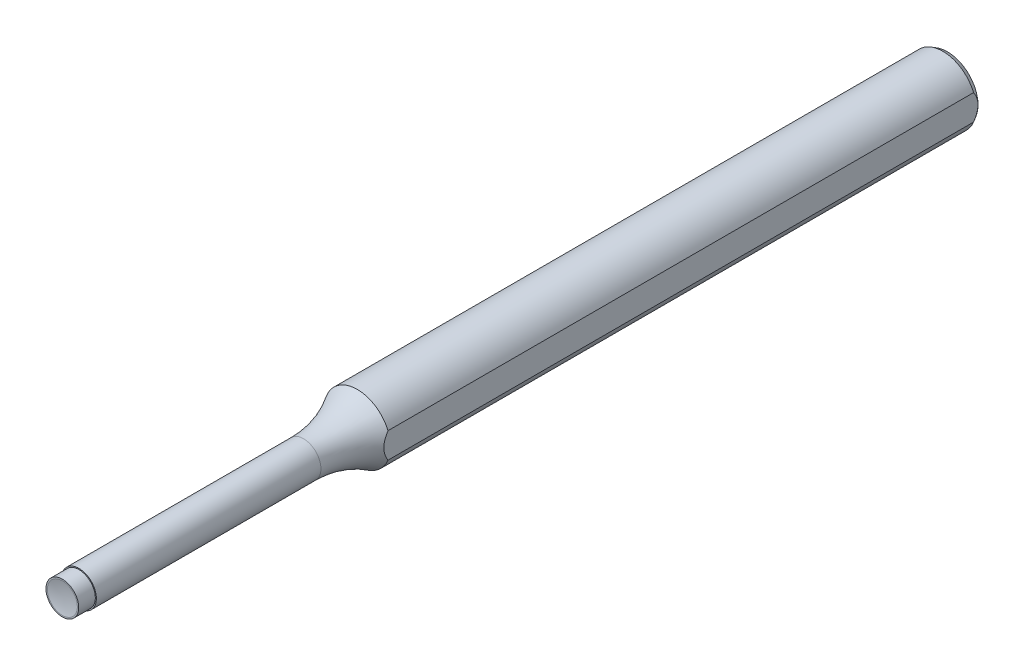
from build123d import *

# Parameters (mm, degrees)
SKETCH1_R           = 4.765
BOSS_EXTRUDE1_DEPTH = 127
SKETCH2_OUTSIDE_W   = 37.072
SKETCH2_OUTSIDE_H   = 37.072
SKETCH2_OUTSIDE_R   = 2.5
CUT_EXTRUDE1_DEPTH  = 42.333333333
SKETCH3_OUTSIDE_W   = 37.072
SKETCH3_OUTSIDE_H   = 37.072
SKETCH3_OUTSIDE_R   = 2.35
CUT_EXTRUDE2_DEPTH  = 2.3825
CHAMFER1_SIZE       = 0.635333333
CHAMFER1_SIZE2      = 0.366809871
SKETCH7_W           = 3.666687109
SKETCH7_H           = 3.66668711
CUT_EXTRUDE3_DEPTH  = 128.178655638


with BuildPart() as part:
    # Sketch1 → Boss-Extrude1 (new body)
    with BuildSketch(Plane.XY):
        Circle(SKETCH1_R)
    extrude(amount=-BOSS_EXTRUDE1_DEPTH)

    # Sketch2 outside → Cut-Extrude1 (cut)
    with BuildSketch(Plane.XY):
        Rectangle(SKETCH2_OUTSIDE_W, SKETCH2_OUTSIDE_H)
        Circle(SKETCH2_OUTSIDE_R, mode=Mode.SUBTRACT)
    extrude(amount=-CUT_EXTRUDE1_DEPTH, mode=Mode.SUBTRACT)

    # Sketch3 outside → Cut-Extrude2 (cut)
    with BuildSketch(Plane.XY):
        Rectangle(SKETCH3_OUTSIDE_W, SKETCH3_OUTSIDE_H)
        Circle(SKETCH3_OUTSIDE_R, mode=Mode.SUBTRACT)
    extrude(amount=-CUT_EXTRUDE2_DEPTH, mode=Mode.SUBTRACT)

    # Sketch4 → Cut-Revolve1 (revolve, cut)
    with BuildSketch(Plane(origin=(0, 0, 0), x_dir=(0, 0, -1), z_dir=(1, 0, 0)), mode=Mode.PRIVATE) as cut_revolve1_sk:
        with BuildLine():
            Line((0, 0), (0, 2.15))
            ThreePointArc((0, 2.15), (0.184068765, 1.081996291), (0.245690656, 0))
            Line((0.245690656, 0), (0, 0))
        make_face()
    revolve(cut_revolve1_sk.sketch.rotate(Axis((0, 0, 0), (0, 0, -1)), 180), axis=Axis((0, 0, 0), (0, 0, -1)), mode=Mode.SUBTRACT)

    # Chamfer1
    chamfer1_edges = [part.edges().sort_by_distance(p)[0] for p in [
        (-4.765, 0, -127),
    ]]
    chamfer1_side = [part.faces().sort_by_distance(p)[0] for p in [
        (-4.765, 0, -84.666666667),
    ]]
    chamfer(chamfer1_edges, length=CHAMFER1_SIZE, length2=CHAMFER1_SIZE2, reference=chamfer1_side[0])

    # Sketch5 → Revolve1 (revolve)
    with BuildSketch(Plane(origin=(0, 0, 0), x_dir=(0, 0, -1), z_dir=(1, 0, 0)), mode=Mode.PRIVATE) as revolve1_sk:
        with BuildLine():
            Line((42.333333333, 0), (34.611537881, 0))
            Line((34.611537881, 0), (34.611537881, 2.5))
            ThreePointArc((34.611537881, 2.5), (38.635104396, 3.07793262), (42.333333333, 4.765))
            Line((42.333333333, 4.765), (42.333333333, 0))
        make_face()
    revolve(revolve1_sk.sketch.rotate(Axis((0, 0, -42.333333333), (0, 0, 1)), 270), axis=Axis((0, 0, -42.333333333), (0, 0, 1)))

    # Sketch7 → Cut-Extrude3 (cut, through all)
    with BuildSketch(Plane(origin=(0, 0, -127), x_dir=(-1, 0, 0), z_dir=(0, 0, -1))):
        with Locations((-6.231533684, 0)):
            Rectangle(SKETCH7_W, SKETCH7_H)
    extrude(amount=-CUT_EXTRUDE3_DEPTH, mode=Mode.SUBTRACT)


solid = part.part
